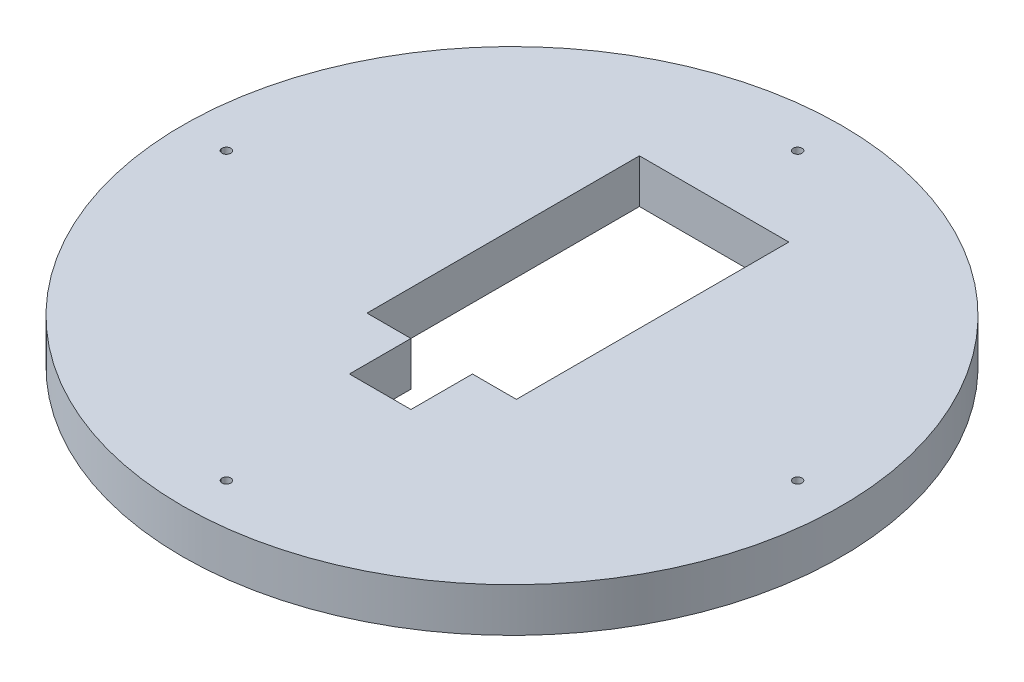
from build123d import *

# Parameters (mm, degrees)
SKETCH1_R           = 37.5
BOSS_EXTRUDE1_DEPTH = 5
CUT_EXTRUDE1_DEPTH  = 5
SKETCH2_R           = 0.5
CUT_EXTRUDE2_DEPTH  = 54.268189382


with BuildPart() as part:
    # Sketch1 → Boss-Extrude1 (new body)
    with BuildSketch(Plane(origin=(0, 0, 0), x_dir=(1, 0, 0), z_dir=(0, 1, 0))):
        with Locations(Location((0, 0, 0), (0, 0, 270))):
            Circle(SKETCH1_R)
    extrude(amount=BOSS_EXTRUDE1_DEPTH)

    # Sketch1_4 → Cut-Extrude1 (cut)
    with BuildSketch(Plane(origin=(0, 0, 0), x_dir=(1, 0, 0), z_dir=(0, 1, 0))):
        Polygon((3.5, -15), (3.5, -8), (8.5, -8), (8.5, 23), (-8.5, 23), (-8.5, -8), (-3.5, -8), (-3.5, -15), align=None)
    extrude(amount=CUT_EXTRUDE1_DEPTH, mode=Mode.SUBTRACT)

    # Sketch2 → Cut-Extrude2 (cut, through all)
    with BuildSketch(Plane(origin=(0, 5, 0), x_dir=(1, 0, 0), z_dir=(0, 1, 0))):
        with Locations(Location((0, 32.5, 0), (0, 0, 270))):
            Circle(SKETCH2_R)
        with Locations(Location((32.5, 0, 0), (0, 0, 270))):
            Circle(SKETCH2_R)
        with Locations(Location((0, -32.5, 0), (0, 0, 270))):
            Circle(SKETCH2_R)
        with Locations(Location((-32.5, 0, 0), (0, 0, 270))):
            Circle(SKETCH2_R)
    extrude(amount=-CUT_EXTRUDE2_DEPTH, mode=Mode.SUBTRACT)


solid = part.part
